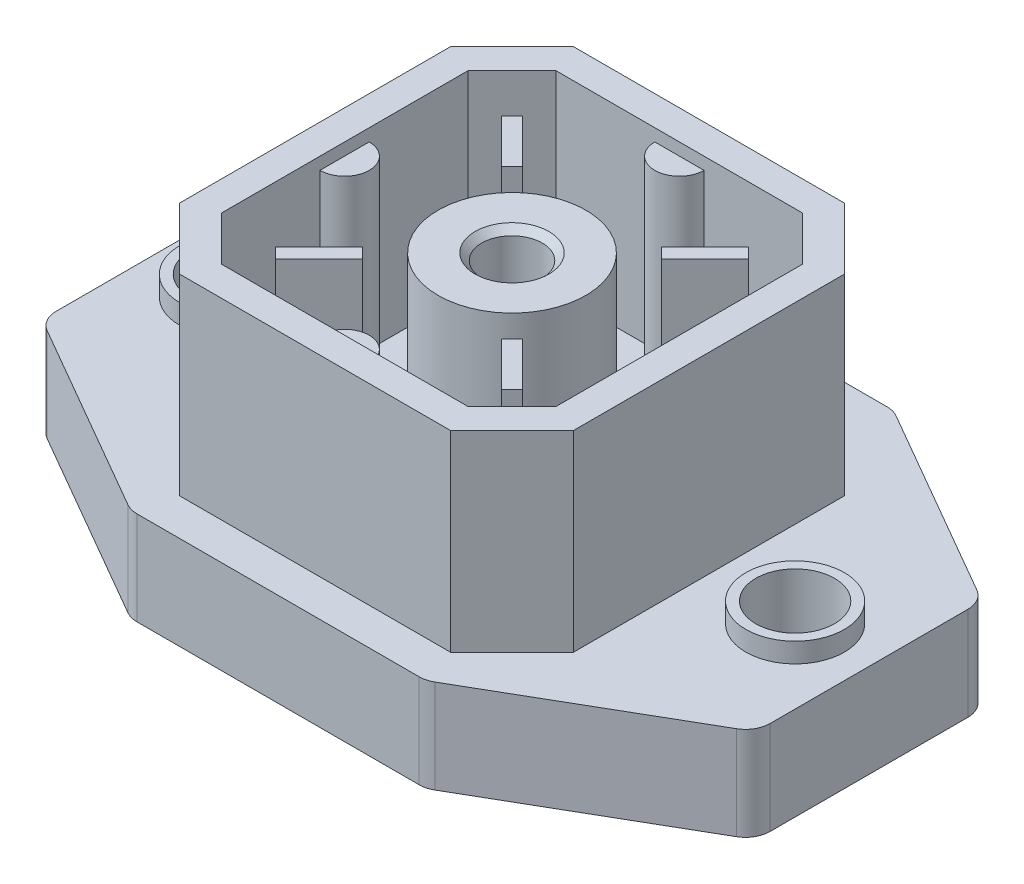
from build123d import *

# Parameters (mm, degrees)
SKIZZE1_R                     = 1.75
LINEAR_AUSTRAGEN1_DEPTH       = 0.8
LINEAR_START                  = 3
LINEAR_AUSTRAGEN2_DEPTH       = 3
LINEAR_AUSTRAGEN3_DEPTH       = 7.8
SKIZZE4_R                     = 2
LINEAR_AUSTRAGEN4_DEPTH       = 0.8
SKIZZE5_R                     = 2
LINEAR_AUSTRAGEN5_DEPTH       = 0.8
SKIZZE6_R                     = 1.6
LINEAR_AUSTRAGEN6_DEPTH       = 3.8
SKIZZE7_R                     = 1.6
LINEAR_AUSTRAGEN7_DEPTH       = 3.8
SKIZZE8_R                     = 3
LINEAR_AUSTRAGEN8_DEPTH       = 7.3
LINEAR_AUSTRAGEN9_DEPTH       = 0.3
LINEAR_AUSTRAGEN9_DEPTH_BACK  = 0.3
SKIZZE10_W                    = 2.5
SKIZZE10_H                    = 7.8
LINEAR_AUSTRAGEN10_DEPTH      = 0.3
LINEAR_AUSTRAGEN10_DEPTH_BACK = 0.3
SKIZZE11_W                    = 2.5
SKIZZE11_H                    = 7.8
LINEAR_AUSTRAGEN11_DEPTH      = 0.3
LINEAR_AUSTRAGEN11_DEPTH_BACK = 0.3
SKIZZE12_W                    = 2.5
SKIZZE12_H                    = 7.8
LINEAR_AUSTRAGEN12_DEPTH      = 0.3
LINEAR_AUSTRAGEN12_DEPTH_BACK = 0.3
SKIZZE13_W                    = 2.5
SKIZZE13_H                    = 7.8
LINEAR_AUSTRAGEN13_DEPTH      = 0.5
LINEAR_AUSTRAGEN13_DEPTH_BACK = 0.5


with BuildPart() as part:
    # Skizze1 → Linear austragen1 (new body)
    with BuildSketch(Plane(origin=(0, 0, 0), x_dir=(1, 0, 0), z_dir=(0, 1, 0))):
        with BuildLine():
            Line((-14.5, 4.015172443), (-14.5, -4.015172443))
            ThreePointArc((-14.5, -4.015172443), (-14.366025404, -4.515172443), (-14, -4.881197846))
            Line((-14, -4.881197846), (-6.232050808, -9.366025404))
            ThreePointArc((-6.232050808, -9.366025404), (-5.990869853, -9.465925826), (-5.732050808, -9.5))
            Line((-5.732050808, -9.5), (5.732050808, -9.5))
            ThreePointArc((5.732050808, -9.5), (5.990869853, -9.465925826), (6.232050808, -9.366025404))
            Line((6.232050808, -9.366025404), (14, -4.881197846))
            ThreePointArc((14, -4.881197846), (14.366025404, -4.515172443), (14.5, -4.015172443))
            Line((14.5, -4.015172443), (14.5, 4.015172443))
            ThreePointArc((14.5, 4.015172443), (14.366025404, 4.515172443), (14, 4.881197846))
            Line((14, 4.881197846), (6.232050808, 9.366025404))
            ThreePointArc((6.232050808, 9.366025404), (5.990869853, 9.465925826), (5.732050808, 9.5))
            Line((5.732050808, 9.5), (-5.732050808, 9.5))
            ThreePointArc((-5.732050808, 9.5), (-5.990869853, 9.465925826), (-6.232050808, 9.366025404))
            Line((-6.232050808, 9.366025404), (-14, 4.881197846))
            ThreePointArc((-14, 4.881197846), (-14.366025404, 4.515172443), (-14.5, 4.015172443))
        make_face()
        with Locations(Location((11.5, 0, 0), (0, 0, 270))):
            Circle(SKIZZE1_R, mode=Mode.SUBTRACT)
        with Locations(Location((-11.5, 0, 0), (0, 0, 270))):
            Circle(SKIZZE1_R, mode=Mode.SUBTRACT)
        Polygon((-8, 5.505739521), (-8, -5.505739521), (-5.505739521, -8), (5.505739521, -8), (8, -5.505739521), (8, 5.505739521), (5.505739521, 8), (-5.505739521, 8), align=None, mode=Mode.SUBTRACT)
    extrude(amount=-LINEAR_AUSTRAGEN1_DEPTH)

    # Skizze2 → Linear austragen2 (add)
    with BuildSketch(Plane(origin=(0, 0, 0), x_dir=(1, 0, 0), z_dir=(0, 1, 0)).offset(LINEAR_START)):
        with BuildLine():
            Line((-14.5, 4.015172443), (-14.5, -4.015172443))
            ThreePointArc((-14.5, -4.015172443), (-14.366025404, -4.515172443), (-14, -4.881197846))
            Line((-14, -4.881197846), (-6.232050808, -9.366025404))
            ThreePointArc((-6.232050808, -9.366025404), (-5.990869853, -9.465925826), (-5.732050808, -9.5))
            Line((-5.732050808, -9.5), (5.732050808, -9.5))
            ThreePointArc((5.732050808, -9.5), (5.990869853, -9.465925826), (6.232050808, -9.366025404))
            Line((6.232050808, -9.366025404), (14, -4.881197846))
            ThreePointArc((14, -4.881197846), (14.366025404, -4.515172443), (14.5, -4.015172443))
            Line((14.5, -4.015172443), (14.5, 4.015172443))
            ThreePointArc((14.5, 4.015172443), (14.366025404, 4.515172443), (14, 4.881197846))
            Line((14, 4.881197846), (6.232050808, 9.366025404))
            ThreePointArc((6.232050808, 9.366025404), (5.990869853, 9.465925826), (5.732050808, 9.5))
            Line((5.732050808, 9.5), (-5.732050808, 9.5))
            ThreePointArc((-5.732050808, 9.5), (-5.990869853, 9.465925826), (-6.232050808, 9.366025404))
            Line((-6.232050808, 9.366025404), (-14, 4.881197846))
            ThreePointArc((-14, 4.881197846), (-14.366025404, 4.515172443), (-14.5, 4.015172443))
        make_face()
    extrude(amount=-LINEAR_AUSTRAGEN2_DEPTH)

    # Skizze3 → Linear austragen3 (add)
    with BuildSketch(Plane(origin=(0, 3, 0), x_dir=(-1, 0, 0), z_dir=(0, 1, 0))):
        Polygon((8, -5.505739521), (8, 5.505739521), (5.505739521, 8), (-5.505739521, 8), (-8, 5.505739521), (-8, -5.505739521), (-5.505739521, -8), (5.505739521, -8), align=None)
        with BuildLine():
            Line((6.8, -5.008683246), (6.8, -1))
            ThreePointArc((6.8, -1), (5.8, 0), (6.8, 1))
            Line((6.8, 1), (6.8, 5.008683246))
            Line((6.8, 5.008683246), (5.008683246, 6.8))
            Line((5.008683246, 6.8), (1, 6.8))
            ThreePointArc((1, 6.8), (0, 5.8), (-1, 6.8))
            Line((-1, 6.8), (-5.008683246, 6.8))
            Line((-5.008683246, 6.8), (-6.8, 5.008683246))
            Line((-6.8, 5.008683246), (-6.8, 1))
            Line((-6.8, 1), (-6.3, 0.866025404))
            Line((-6.3, 0.866025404), (-6.3, -0.866025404))
            Line((-6.3, -0.866025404), (-6.8, -1))
            Line((-6.8, -1), (-6.8, -5.008683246))
            Line((-6.8, -5.008683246), (-5.008683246, -6.8))
            Line((-5.008683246, -6.8), (-1, -6.8))
            ThreePointArc((-1, -6.8), (0, -5.8), (1, -6.8))
            Line((1, -6.8), (5.008683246, -6.8))
            Line((5.008683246, -6.8), (6.8, -5.008683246))
        make_face(mode=Mode.SUBTRACT)
    extrude(amount=LINEAR_AUSTRAGEN3_DEPTH)

    # Skizze4 → Linear austragen4 (add)
    with BuildSketch(Plane(origin=(0, 3, 0), x_dir=(-1, 0, 0), z_dir=(0, 1, 0))):
        with Locations(Location((-11.5, 0, 0), (0, 0, 90))):
            Circle(SKIZZE4_R)
    extrude(amount=LINEAR_AUSTRAGEN4_DEPTH)

    # Skizze5 → Linear austragen5 (add)
    with BuildSketch(Plane(origin=(0, 3, 0), x_dir=(-1, 0, 0), z_dir=(0, 1, 0))):
        with Locations(Location((11.5, 0, 0), (0, 0, 90))):
            Circle(SKIZZE5_R)
    extrude(amount=LINEAR_AUSTRAGEN5_DEPTH)

    # Skizze6 → Linear austragen6 (cut)
    with BuildSketch(Plane(origin=(0, 3.8, 0), x_dir=(-1, 0, 0), z_dir=(0, 1, 0))):
        with Locations(Location((-11.5, 0, 0), (0, 0, 90))):
            Circle(SKIZZE6_R)
    extrude(amount=-LINEAR_AUSTRAGEN6_DEPTH, mode=Mode.SUBTRACT)

    # Skizze7 → Linear austragen7 (cut)
    with BuildSketch(Plane(origin=(0, 3.8, 0), x_dir=(-1, 0, 0), z_dir=(0, 1, 0))):
        with Locations(Location((11.5, 0, 0), (0, 0, 90))):
            Circle(SKIZZE7_R)
    extrude(amount=-LINEAR_AUSTRAGEN7_DEPTH, mode=Mode.SUBTRACT)

    # Skizze8 → Linear austragen8 (add)
    with BuildSketch(Plane(origin=(0, 3, 0), x_dir=(-1, 0, 0), z_dir=(0, 1, 0))):
        with Locations(Location((0, 0, 0), (0, 0, 90))):
            Circle(SKIZZE8_R)
    extrude(amount=LINEAR_AUSTRAGEN8_DEPTH)

    # Skizze9 → Schnitt-Rotation1 (revolve, cut)
    with BuildSketch(Plane(origin=(0, 0, 0), x_dir=(0, 0, -1), z_dir=(1, 0, 0)), mode=Mode.PRIVATE) as schnitt_rotation1_sk:
        Polygon((0, 10.3), (1.5, 10.3), (1.2295, 10.0295), (1.2295, 1), (0, 0.290147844), align=None)
    revolve(schnitt_rotation1_sk.sketch.rotate(Axis((0, 0.290147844, 0), (0, 1, 0)), 180), axis=Axis((0, 0.290147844, 0), (0, 1, 0)), mode=Mode.SUBTRACT)

    # Skizze10 → Linear austragen9 (add, two sides: drawn at the far end of the back side and taken through both)
    with BuildSketch(Plane(origin=(0, 0, 0), x_dir=(-0.7071067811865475, 0, -0.7071067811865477), z_dir=(0.7071067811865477, 0, -0.7071067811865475)).offset(-LINEAR_AUSTRAGEN9_DEPTH_BACK)):
        with Locations((5.55, 6.9)):
            Rectangle(SKIZZE10_W, SKIZZE10_H)
    extrude(amount=LINEAR_AUSTRAGEN9_DEPTH + LINEAR_AUSTRAGEN9_DEPTH_BACK)

    # Skizze11 → Linear austragen10 (add, two sides: drawn at the far end of the back side and taken through both)
    with BuildSketch(Plane(origin=(0, 0, 0), x_dir=(-0.7071067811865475, 0, -0.7071067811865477), z_dir=(0.7071067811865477, 0, -0.7071067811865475)).offset(-LINEAR_AUSTRAGEN10_DEPTH_BACK)):
        with Locations((-5.55, 6.9)):
            Rectangle(SKIZZE11_W, SKIZZE11_H)
    extrude(amount=LINEAR_AUSTRAGEN10_DEPTH + LINEAR_AUSTRAGEN10_DEPTH_BACK)

    # Skizze12 → Linear austragen11 (add, two sides: drawn at the far end of the back side and taken through both)
    with BuildSketch(Plane(origin=(0, 0, 0), x_dir=(0.7071067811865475, 0, -0.7071067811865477), z_dir=(0.7071067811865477, 0, 0.7071067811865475)).offset(-LINEAR_AUSTRAGEN11_DEPTH_BACK)):
        with Locations((5.55, 6.9)):
            Rectangle(SKIZZE12_W, SKIZZE12_H)
    extrude(amount=LINEAR_AUSTRAGEN11_DEPTH + LINEAR_AUSTRAGEN11_DEPTH_BACK)

    # Skizze13 → Linear austragen12 (add, two sides: drawn at the far end of the back side and taken through both)
    with BuildSketch(Plane(origin=(0, 0, 0), x_dir=(0.7071067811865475, 0, -0.7071067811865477), z_dir=(0.7071067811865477, 0, 0.7071067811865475)).offset(-LINEAR_AUSTRAGEN12_DEPTH_BACK)):
        with Locations((-5.55, 6.9)):
            Rectangle(SKIZZE13_W, SKIZZE13_H)
    extrude(amount=LINEAR_AUSTRAGEN12_DEPTH + LINEAR_AUSTRAGEN12_DEPTH_BACK)

    # Skizze14 → Rotation1 (revolve)
    with BuildSketch(Plane(origin=(0, 0, 0), x_dir=(0.7071067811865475, 0, -0.7071067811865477), z_dir=(0.7071067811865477, 0, 0.7071067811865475)), mode=Mode.PRIVATE) as rotation1_sk:
        with BuildLine():
            Line((5.75, 0), (6.25, 0))
            Line((6.25, 0), (6.25, -3.5))
            ThreePointArc((6.25, -3.5), (6.103553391, -3.853553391), (5.75, -4))
            Line((5.75, -4), (5.75, 0))
        make_face()
    revolve(rotation1_sk.sketch.rotate(Axis((4.065863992, -4, -4.065863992), (0, 1, 0)), 225), axis=Axis((4.065863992, -4, -4.065863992), (0, 1, 0)))

    # Skizze15 → Rotation2 (revolve)
    with BuildSketch(Plane(origin=(0, 0, 0), x_dir=(0.7071067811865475, 0, -0.7071067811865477), z_dir=(0.7071067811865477, 0, 0.7071067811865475)), mode=Mode.PRIVATE) as rotation2_sk:
        with BuildLine():
            Line((-5.75, 0), (-5.25, 0))
            Line((-5.25, 0), (-5.25, -3.5))
            ThreePointArc((-5.25, -3.5), (-5.396446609, -3.853553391), (-5.75, -4))
            Line((-5.75, -4), (-5.75, 0))
        make_face()
    revolve(rotation2_sk.sketch.rotate(Axis((-4.065863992, -4, 4.065863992), (0, 1, 0)), 225), axis=Axis((-4.065863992, -4, 4.065863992), (0, 1, 0)))

    # Skizze16 → Rotation3 (revolve)
    with BuildSketch(Plane(origin=(0, 0, 0), x_dir=(-0.7071067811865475, 0, -0.7071067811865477), z_dir=(0.7071067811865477, 0, -0.7071067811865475)), mode=Mode.PRIVATE) as rotation3_sk:
        with BuildLine():
            Line((5.75, 0), (6.25, 0))
            Line((6.25, 0), (6.25, -3.5))
            ThreePointArc((6.25, -3.5), (6.103553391, -3.853553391), (5.75, -4))
            Line((5.75, -4), (5.75, 0))
        make_face()
    revolve(rotation3_sk.sketch.rotate(Axis((-4.065863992, -4, -4.065863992), (0, 1, 0)), 135), axis=Axis((-4.065863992, -4, -4.065863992), (0, 1, 0)))

    # Skizze17 → Rotation4 (revolve)
    with BuildSketch(Plane(origin=(0, 0, 0), x_dir=(-0.7071067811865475, 0, -0.7071067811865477), z_dir=(0.7071067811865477, 0, -0.7071067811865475)), mode=Mode.PRIVATE) as rotation4_sk:
        with BuildLine():
            Line((-5.75, 0), (-5.25, 0))
            Line((-5.25, 0), (-5.25, -3.5))
            ThreePointArc((-5.25, -3.5), (-5.396446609, -3.853553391), (-5.75, -4))
            Line((-5.75, -4), (-5.75, 0))
        make_face()
    revolve(rotation4_sk.sketch.rotate(Axis((4.065863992, -4, 4.065863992), (0, 1, 0)), 135), axis=Axis((4.065863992, -4, 4.065863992), (0, 1, 0)))

    # Skizze18 → Linear austragen13 (cut, two sides: drawn at the far end of the back side and taken through both)
    with BuildSketch(Plane(origin=(0, 10.8, 0), x_dir=(-1, 0, 0), z_dir=(0, 1, 0)).offset(-LINEAR_AUSTRAGEN13_DEPTH_BACK)):
        Polygon((6.8, 5), (5, 6.8), (-5, 6.8), (-6.8, 5), (-6.8, -5), (-5, -6.8), (5, -6.8), (6.8, -5), align=None)
    extrude(amount=LINEAR_AUSTRAGEN13_DEPTH + LINEAR_AUSTRAGEN13_DEPTH_BACK, mode=Mode.SUBTRACT)


solid = part.part
